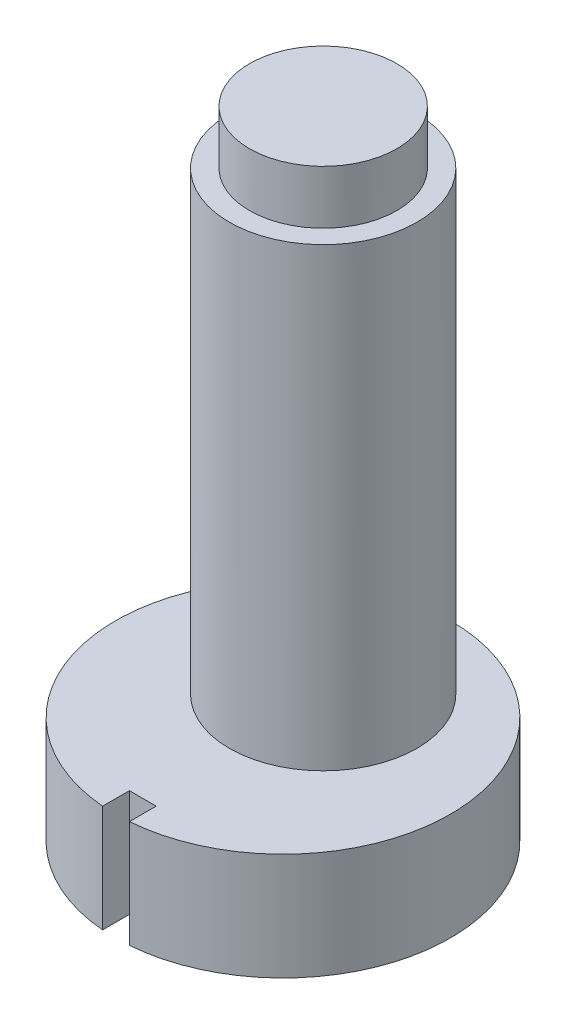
ISO-10303-21;
HEADER;
FILE_DESCRIPTION(('STEP AP214'),'2;1');
FILE_NAME('part.step','',(''),(''),'','','');
FILE_SCHEMA(('AUTOMOTIVE_DESIGN { 1 0 10303 214 1 1 1 1 }'));
ENDSEC;
DATA;
#1=APPLICATION_CONTEXT('core data for automotive mechanical design processes');
#2=APPLICATION_PROTOCOL_DEFINITION('international standard','automotive_design',2000,#1);
#3=PRODUCT_CONTEXT('',#1,'mechanical');
#4=PRODUCT('Part','Part','',(#3));
#5=PRODUCT_RELATED_PRODUCT_CATEGORY('part','',(#4));
#6=PRODUCT_DEFINITION_FORMATION('','',#4);
#7=PRODUCT_DEFINITION_CONTEXT('part definition',#1,'design');
#8=PRODUCT_DEFINITION('design','',#6,#7);
#9=PRODUCT_DEFINITION_SHAPE('','',#8);
#10=(LENGTH_UNIT() NAMED_UNIT(*) SI_UNIT(.MILLI.,.METRE.));
#11=(NAMED_UNIT(*) PLANE_ANGLE_UNIT() SI_UNIT($,.RADIAN.));
#12=(NAMED_UNIT(*) SI_UNIT($,.STERADIAN.) SOLID_ANGLE_UNIT());
#13=UNCERTAINTY_MEASURE_WITH_UNIT(LENGTH_MEASURE(1.E-05),#10,'distance_accuracy_value','');
#14=(GEOMETRIC_REPRESENTATION_CONTEXT(3) GLOBAL_UNCERTAINTY_ASSIGNED_CONTEXT((#13)) GLOBAL_UNIT_ASSIGNED_CONTEXT((#10,
#11,#12)) REPRESENTATION_CONTEXT('',''));
#15=CARTESIAN_POINT('',(0.,0.,0.));
#16=DIRECTION('',(0.,0.,1.));
#17=DIRECTION('',(1.,0.,0.));
#18=AXIS2_PLACEMENT_3D('',#15,#16,#17);
#19=CARTESIAN_POINT('',(0.,21.,-1.5));
#20=DIRECTION('',(0.,-1.,0.));
#21=DIRECTION('',(0.,0.,-1.));
#22=AXIS2_PLACEMENT_3D('',#19,#20,#21);
#23=CYLINDRICAL_SURFACE('',#22,3.5);
#24=CARTESIAN_POINT('',(0.,4.,-1.5));
#25=DIRECTION('',(0.,1.,0.));
#26=DIRECTION('',(0.,0.,1.));
#27=AXIS2_PLACEMENT_3D('',#24,#25,#26);
#28=CIRCLE('',#27,3.5);
#29=CARTESIAN_POINT('',(0.,4.,2.));
#30=VERTEX_POINT('',#29);
#31=EDGE_CURVE('E48',#30,#30,#28,.T.);
#32=ORIENTED_EDGE('',*,*,#31,.T.);
#33=EDGE_LOOP('',(#32));
#34=FACE_BOUND('',#33,.T.);
#35=DIRECTION('',(0.,1.,0.));
#36=VECTOR('',#35,1.);
#37=CARTESIAN_POINT('',(-3.49220062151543,11.,-1.73352691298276));
#38=LINE('',#37,#36);
#39=CARTESIAN_POINT('',(-3.49220062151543,11.,-1.73352691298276));
#40=VERTEX_POINT('',#39);
#41=CARTESIAN_POINT('',(-3.49220062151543,21.,-1.73352691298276));
#42=VERTEX_POINT('',#41);
#43=EDGE_CURVE('E123',#40,#42,#38,.T.);
#44=ORIENTED_EDGE('',*,*,#43,.F.);
#45=CARTESIAN_POINT('',(0.,11.,-1.5));
#46=DIRECTION('',(0.,1.,0.));
#47=DIRECTION('',(0.,0.,1.));
#48=AXIS2_PLACEMENT_3D('',#45,#46,#47);
#49=CIRCLE('',#48,3.5);
#50=CARTESIAN_POINT('',(-2.51283532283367,11.,-3.93632071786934));
#51=VERTEX_POINT('',#50);
#52=EDGE_CURVE('E106',#51,#40,#49,.T.);
#53=ORIENTED_EDGE('',*,*,#52,.F.);
#54=DIRECTION('',(0.,1.,0.));
#55=VECTOR('',#54,1.);
#56=CARTESIAN_POINT('',(-2.51283532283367,11.,-3.93632071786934));
#57=LINE('',#56,#55);
#58=CARTESIAN_POINT('',(-2.51283532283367,21.,-3.93632071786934));
#59=VERTEX_POINT('',#58);
#60=EDGE_CURVE('E105',#51,#59,#57,.T.);
#61=ORIENTED_EDGE('',*,*,#60,.T.);
#62=CARTESIAN_POINT('',(0.,21.,-1.5));
#63=DIRECTION('',(0.,1.,0.));
#64=DIRECTION('',(0.,0.,1.));
#65=AXIS2_PLACEMENT_3D('',#62,#63,#64);
#66=CIRCLE('',#65,3.5);
#67=EDGE_CURVE('E151',#42,#59,#66,.T.);
#68=ORIENTED_EDGE('',*,*,#67,.F.);
#69=EDGE_LOOP('',(#44,#53,#61,#68));
#70=FACE_BOUND('',#69,.T.);
#71=ADVANCED_FACE('F39',(#34,#70),#23,.T.);
#72=CARTESIAN_POINT('',(0.,21.,-1.5));
#73=DIRECTION('',(0.,1.,0.));
#74=DIRECTION('',(0.,0.,1.));
#75=AXIS2_PLACEMENT_3D('',#72,#73,#74);
#76=PLANE('',#75);
#77=CARTESIAN_POINT('',(0.,21.,-1.5));
#78=DIRECTION('',(0.,1.,0.));
#79=DIRECTION('',(0.,0.,1.));
#80=AXIS2_PLACEMENT_3D('',#77,#78,#79);
#81=CIRCLE('',#80,2.75);
#82=CARTESIAN_POINT('',(-2.51283532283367,21.,-2.61721020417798));
#83=VERTEX_POINT('',#82);
#84=EDGE_CURVE('E11',#83,#83,#81,.T.);
#85=ORIENTED_EDGE('',*,*,#84,.F.);
#86=DIRECTION('',(-0.742443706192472,0.,0.669908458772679));
#87=VECTOR('',#86,1.);
#88=CARTESIAN_POINT('',(-2.42942361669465,21.,-2.69247275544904));
#89=LINE('',#88,#87);
#90=EDGE_CURVE('E56',#83,#42,#89,.T.);
#91=ORIENTED_EDGE('',*,*,#90,.T.);
#92=ORIENTED_EDGE('',*,*,#67,.T.);
#93=DIRECTION('',(0.,0.,-1.));
#94=VECTOR('',#93,1.);
#95=CARTESIAN_POINT('',(-2.51283532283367,21.,0.));
#96=LINE('',#95,#94);
#97=EDGE_CURVE('E114',#83,#59,#96,.T.);
#98=ORIENTED_EDGE('',*,*,#97,.F.);
#99=EDGE_LOOP('',(#85,#91,#92,#98));
#100=FACE_BOUND('',#99,.T.);
#101=ADVANCED_FACE('F188',(#100),#76,.T.);
#102=CARTESIAN_POINT('',(0.,4.,0.));
#103=DIRECTION('',(0.,-1.,0.));
#104=DIRECTION('',(0.,0.,-1.));
#105=AXIS2_PLACEMENT_3D('',#102,#103,#104);
#106=CYLINDRICAL_SURFACE('',#105,6.25);
#107=CARTESIAN_POINT('',(0.,0.,0.));
#108=DIRECTION('',(0.,1.,0.));
#109=DIRECTION('',(0.,0.,1.));
#110=AXIS2_PLACEMENT_3D('',#107,#108,#109);
#111=CIRCLE('',#110,6.25);
#112=CARTESIAN_POINT('',(0.5,0.,6.22996789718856));
#113=VERTEX_POINT('',#112);
#114=CARTESIAN_POINT('',(-0.5,0.,6.22996789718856));
#115=VERTEX_POINT('',#114);
#116=EDGE_CURVE('E43',#113,#115,#111,.T.);
#117=ORIENTED_EDGE('',*,*,#116,.T.);
#118=DIRECTION('',(0.,1.,0.));
#119=VECTOR('',#118,1.);
#120=CARTESIAN_POINT('',(-0.5,-0.00100000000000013,6.22996789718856));
#121=LINE('',#120,#119);
#122=CARTESIAN_POINT('',(-0.5,4.,6.22996789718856));
#123=VERTEX_POINT('',#122);
#124=EDGE_CURVE('E139',#115,#123,#121,.T.);
#125=ORIENTED_EDGE('',*,*,#124,.T.);
#126=CARTESIAN_POINT('',(0.,4.,0.));
#127=DIRECTION('',(0.,1.,0.));
#128=DIRECTION('',(0.,0.,1.));
#129=AXIS2_PLACEMENT_3D('',#126,#127,#128);
#130=CIRCLE('',#129,6.25);
#131=CARTESIAN_POINT('',(0.5,4.,6.22996789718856));
#132=VERTEX_POINT('',#131);
#133=EDGE_CURVE('E156',#132,#123,#130,.T.);
#134=ORIENTED_EDGE('',*,*,#133,.F.);
#135=DIRECTION('',(0.,1.,0.));
#136=VECTOR('',#135,1.);
#137=CARTESIAN_POINT('',(0.5,-0.00100000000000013,6.22996789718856));
#138=LINE('',#137,#136);
#139=EDGE_CURVE('E138',#113,#132,#138,.T.);
#140=ORIENTED_EDGE('',*,*,#139,.F.);
#141=EDGE_LOOP('',(#117,#125,#134,#140));
#142=FACE_BOUND('',#141,.T.);
#143=ADVANCED_FACE('F41',(#142),#106,.T.);
#144=CARTESIAN_POINT('',(0.,4.,0.));
#145=DIRECTION('',(0.,1.,0.));
#146=DIRECTION('',(0.,0.,1.));
#147=AXIS2_PLACEMENT_3D('',#144,#145,#146);
#148=PLANE('',#147);
#149=DIRECTION('',(0.,0.,1.));
#150=VECTOR('',#149,1.);
#151=CARTESIAN_POINT('',(-0.5,4.,6.22996789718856));
#152=LINE('',#151,#150);
#153=CARTESIAN_POINT('',(-0.5,4.,5.22996789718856));
#154=VERTEX_POINT('',#153);
#155=EDGE_CURVE('E136',#154,#123,#152,.T.);
#156=ORIENTED_EDGE('',*,*,#155,.F.);
#157=DIRECTION('',(-1.,0.,0.));
#158=VECTOR('',#157,1.);
#159=CARTESIAN_POINT('',(-0.5,4.,5.22996789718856));
#160=LINE('',#159,#158);
#161=CARTESIAN_POINT('',(0.5,4.,5.22996789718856));
#162=VERTEX_POINT('',#161);
#163=EDGE_CURVE('E133',#162,#154,#160,.T.);
#164=ORIENTED_EDGE('',*,*,#163,.F.);
#165=DIRECTION('',(0.,0.,-1.));
#166=VECTOR('',#165,1.);
#167=CARTESIAN_POINT('',(0.5,4.,5.22996789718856));
#168=LINE('',#167,#166);
#169=EDGE_CURVE('E130',#132,#162,#168,.T.);
#170=ORIENTED_EDGE('',*,*,#169,.F.);
#171=ORIENTED_EDGE('',*,*,#133,.T.);
#172=EDGE_LOOP('',(#156,#164,#170,#171));
#173=FACE_BOUND('',#172,.T.);
#174=ORIENTED_EDGE('',*,*,#31,.F.);
#175=EDGE_LOOP('',(#174));
#176=FACE_BOUND('',#175,.T.);
#177=ADVANCED_FACE('F173',(#173,#176),#148,.T.);
#178=CARTESIAN_POINT('',(0.,0.,0.));
#179=DIRECTION('',(0.,1.,0.));
#180=DIRECTION('',(0.,0.,1.));
#181=AXIS2_PLACEMENT_3D('',#178,#179,#180);
#182=PLANE('',#181);
#183=DIRECTION('',(1.,0.,0.));
#184=VECTOR('',#183,1.);
#185=CARTESIAN_POINT('',(-0.5,0.,5.22996789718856));
#186=LINE('',#185,#184);
#187=CARTESIAN_POINT('',(-0.5,0.,5.22996789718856));
#188=VERTEX_POINT('',#187);
#189=CARTESIAN_POINT('',(0.5,0.,5.22996789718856));
#190=VERTEX_POINT('',#189);
#191=EDGE_CURVE('E64',#188,#190,#186,.T.);
#192=ORIENTED_EDGE('',*,*,#191,.F.);
#193=DIRECTION('',(0.,0.,-1.));
#194=VECTOR('',#193,1.);
#195=CARTESIAN_POINT('',(-0.5,0.,6.22996789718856));
#196=LINE('',#195,#194);
#197=EDGE_CURVE('E127',#115,#188,#196,.T.);
#198=ORIENTED_EDGE('',*,*,#197,.F.);
#199=ORIENTED_EDGE('',*,*,#116,.F.);
#200=DIRECTION('',(0.,0.,1.));
#201=VECTOR('',#200,1.);
#202=CARTESIAN_POINT('',(0.5,0.,5.22996789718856));
#203=LINE('',#202,#201);
#204=EDGE_CURVE('E142',#190,#113,#203,.T.);
#205=ORIENTED_EDGE('',*,*,#204,.F.);
#206=EDGE_LOOP('',(#192,#198,#199,#205));
#207=FACE_BOUND('',#206,.T.);
#208=ADVANCED_FACE('F169',(#207),#182,.F.);
#209=CARTESIAN_POINT('',(0.,23.,-1.5));
#210=DIRECTION('',(0.,-1.,0.));
#211=DIRECTION('',(0.,0.,-1.));
#212=AXIS2_PLACEMENT_3D('',#209,#210,#211);
#213=CYLINDRICAL_SURFACE('',#212,2.75);
#214=CARTESIAN_POINT('',(0.,23.,-1.5));
#215=DIRECTION('',(0.,1.,0.));
#216=DIRECTION('',(0.,0.,1.));
#217=AXIS2_PLACEMENT_3D('',#214,#215,#216);
#218=CIRCLE('',#217,2.75);
#219=CARTESIAN_POINT('',(0.,23.,1.25));
#220=VERTEX_POINT('',#219);
#221=EDGE_CURVE('E149',#220,#220,#218,.T.);
#222=ORIENTED_EDGE('',*,*,#221,.F.);
#223=EDGE_LOOP('',(#222));
#224=FACE_BOUND('',#223,.T.);
#225=ORIENTED_EDGE('',*,*,#84,.T.);
#226=EDGE_LOOP('',(#225));
#227=FACE_BOUND('',#226,.T.);
#228=ADVANCED_FACE('F201',(#224,#227),#213,.T.);
#229=CARTESIAN_POINT('',(0.,23.,-1.5));
#230=DIRECTION('',(0.,1.,0.));
#231=DIRECTION('',(0.,0.,1.));
#232=AXIS2_PLACEMENT_3D('',#229,#230,#231);
#233=PLANE('',#232);
#234=ORIENTED_EDGE('',*,*,#221,.T.);
#235=EDGE_LOOP('',(#234));
#236=FACE_BOUND('',#235,.T.);
#237=ADVANCED_FACE('F206',(#236),#233,.T.);
#238=CARTESIAN_POINT('',(-0.5,-0.00100000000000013,6.22996789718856));
#239=DIRECTION('',(-1.,0.,0.));
#240=DIRECTION('',(0.,0.,1.));
#241=AXIS2_PLACEMENT_3D('',#238,#239,#240);
#242=PLANE('',#241);
#243=ORIENTED_EDGE('',*,*,#197,.T.);
#244=DIRECTION('',(0.,1.,0.));
#245=VECTOR('',#244,1.);
#246=CARTESIAN_POINT('',(-0.5,-0.00100000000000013,5.22996789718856));
#247=LINE('',#246,#245);
#248=EDGE_CURVE('E143',#188,#154,#247,.T.);
#249=ORIENTED_EDGE('',*,*,#248,.T.);
#250=ORIENTED_EDGE('',*,*,#155,.T.);
#251=ORIENTED_EDGE('',*,*,#124,.F.);
#252=EDGE_LOOP('',(#243,#249,#250,#251));
#253=FACE_BOUND('',#252,.T.);
#254=ADVANCED_FACE('F171',(#253),#242,.F.);
#255=CARTESIAN_POINT('',(-0.5,-0.00100000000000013,5.22996789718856));
#256=DIRECTION('',(0.,0.,-1.));
#257=DIRECTION('',(-1.,0.,0.));
#258=AXIS2_PLACEMENT_3D('',#255,#256,#257);
#259=PLANE('',#258);
#260=ORIENTED_EDGE('',*,*,#191,.T.);
#261=DIRECTION('',(0.,1.,0.));
#262=VECTOR('',#261,1.);
#263=CARTESIAN_POINT('',(0.5,-0.00100000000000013,5.22996789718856));
#264=LINE('',#263,#262);
#265=EDGE_CURVE('E145',#190,#162,#264,.T.);
#266=ORIENTED_EDGE('',*,*,#265,.T.);
#267=ORIENTED_EDGE('',*,*,#163,.T.);
#268=ORIENTED_EDGE('',*,*,#248,.F.);
#269=EDGE_LOOP('',(#260,#266,#267,#268));
#270=FACE_BOUND('',#269,.T.);
#271=ADVANCED_FACE('F175',(#270),#259,.F.);
#272=CARTESIAN_POINT('',(0.5,-0.00100000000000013,5.22996789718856));
#273=DIRECTION('',(1.,0.,0.));
#274=DIRECTION('',(0.,0.,-1.));
#275=AXIS2_PLACEMENT_3D('',#272,#273,#274);
#276=PLANE('',#275);
#277=ORIENTED_EDGE('',*,*,#204,.T.);
#278=ORIENTED_EDGE('',*,*,#139,.T.);
#279=ORIENTED_EDGE('',*,*,#169,.T.);
#280=ORIENTED_EDGE('',*,*,#265,.F.);
#281=EDGE_LOOP('',(#277,#278,#279,#280));
#282=FACE_BOUND('',#281,.T.);
#283=ADVANCED_FACE('F177',(#282),#276,.F.);
#284=CARTESIAN_POINT('',(-2.42942361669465,11.,-2.69247275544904));
#285=DIRECTION('',(-0.669908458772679,0.,-0.742443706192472));
#286=DIRECTION('',(-0.742443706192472,0.,0.669908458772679));
#287=AXIS2_PLACEMENT_3D('',#284,#285,#286);
#288=PLANE('',#287);
#289=ORIENTED_EDGE('',*,*,#90,.F.);
#290=DIRECTION('',(0.,1.,0.));
#291=VECTOR('',#290,1.);
#292=CARTESIAN_POINT('',(-2.51283532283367,11.,-2.61721020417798));
#293=LINE('',#292,#291);
#294=CARTESIAN_POINT('',(-2.51283532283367,11.,-2.61721020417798));
#295=VERTEX_POINT('',#294);
#296=EDGE_CURVE('E97',#295,#83,#293,.T.);
#297=ORIENTED_EDGE('',*,*,#296,.F.);
#298=DIRECTION('',(-0.742443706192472,0.,0.669908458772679));
#299=VECTOR('',#298,1.);
#300=CARTESIAN_POINT('',(-2.42942361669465,11.,-2.69247275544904));
#301=LINE('',#300,#299);
#302=EDGE_CURVE('E100',#295,#40,#301,.T.);
#303=ORIENTED_EDGE('',*,*,#302,.T.);
#304=ORIENTED_EDGE('',*,*,#43,.T.);
#305=EDGE_LOOP('',(#289,#297,#303,#304));
#306=FACE_BOUND('',#305,.T.);
#307=ADVANCED_FACE('F99',(#306),#288,.T.);
#308=CARTESIAN_POINT('',(-2.51283532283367,11.,0.));
#309=DIRECTION('',(1.,0.,0.));
#310=DIRECTION('',(0.,0.,-1.));
#311=AXIS2_PLACEMENT_3D('',#308,#309,#310);
#312=PLANE('',#311);
#313=ORIENTED_EDGE('',*,*,#97,.T.);
#314=ORIENTED_EDGE('',*,*,#60,.F.);
#315=DIRECTION('',(0.,0.,-1.));
#316=VECTOR('',#315,1.);
#317=CARTESIAN_POINT('',(-2.51283532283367,11.,0.));
#318=LINE('',#317,#316);
#319=EDGE_CURVE('E111',#295,#51,#318,.T.);
#320=ORIENTED_EDGE('',*,*,#319,.F.);
#321=ORIENTED_EDGE('',*,*,#296,.T.);
#322=EDGE_LOOP('',(#313,#314,#320,#321));
#323=FACE_BOUND('',#322,.T.);
#324=ADVANCED_FACE('F116',(#323),#312,.F.);
#325=CARTESIAN_POINT('',(0.,11.,0.));
#326=DIRECTION('',(0.,1.,0.));
#327=DIRECTION('',(0.,0.,1.));
#328=AXIS2_PLACEMENT_3D('',#325,#326,#327);
#329=PLANE('',#328);
#330=ORIENTED_EDGE('',*,*,#302,.F.);
#331=ORIENTED_EDGE('',*,*,#319,.T.);
#332=ORIENTED_EDGE('',*,*,#52,.T.);
#333=EDGE_LOOP('',(#330,#331,#332));
#334=FACE_BOUND('',#333,.T.);
#335=ADVANCED_FACE('F110',(#334),#329,.T.);
#336=CLOSED_SHELL('',(#71,#101,#143,#177,#208,#228,#237,#254,#271,#283,#307,#324,#335));
#337=MANIFOLD_SOLID_BREP('B2',#336);
#338=ADVANCED_BREP_SHAPE_REPRESENTATION('',(#18,#337),#14);
#339=SHAPE_DEFINITION_REPRESENTATION(#9,#338);
ENDSEC;
END-ISO-10303-21;
